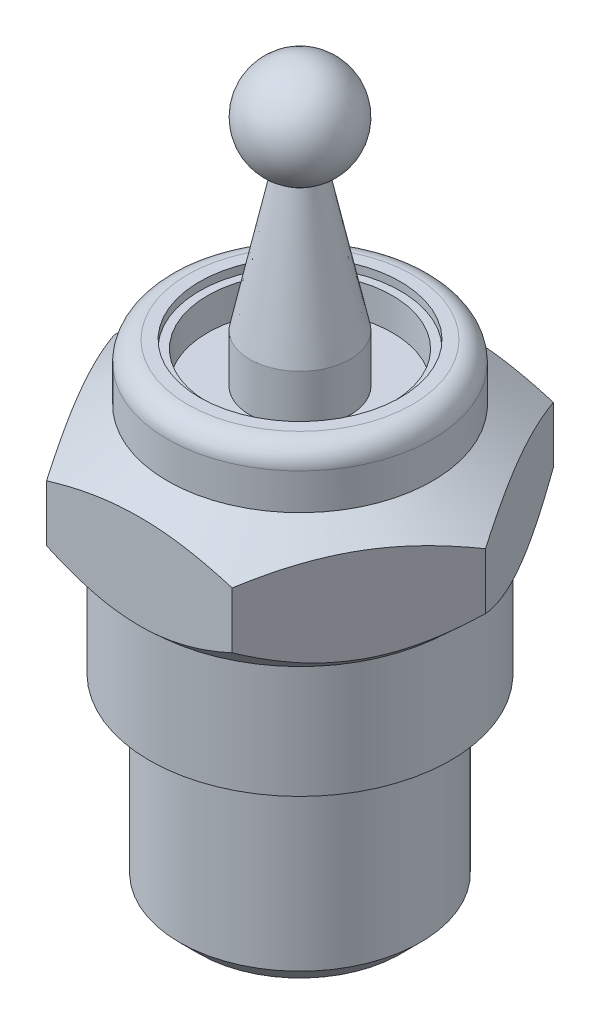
ISO-10303-21;
HEADER;
FILE_DESCRIPTION(('STEP AP214'),'2;1');
FILE_NAME('part.step','',(''),(''),'','','');
FILE_SCHEMA(('AUTOMOTIVE_DESIGN { 1 0 10303 214 1 1 1 1 }'));
ENDSEC;
DATA;
#1=APPLICATION_CONTEXT('core data for automotive mechanical design processes');
#2=APPLICATION_PROTOCOL_DEFINITION('international standard','automotive_design',2000,#1);
#3=PRODUCT_CONTEXT('',#1,'mechanical');
#4=PRODUCT('Part','Part','',(#3));
#5=PRODUCT_RELATED_PRODUCT_CATEGORY('part','',(#4));
#6=PRODUCT_DEFINITION_FORMATION('','',#4);
#7=PRODUCT_DEFINITION_CONTEXT('part definition',#1,'design');
#8=PRODUCT_DEFINITION('design','',#6,#7);
#9=PRODUCT_DEFINITION_SHAPE('','',#8);
#10=(LENGTH_UNIT() NAMED_UNIT(*) SI_UNIT(.MILLI.,.METRE.));
#11=(NAMED_UNIT(*) PLANE_ANGLE_UNIT() SI_UNIT($,.RADIAN.));
#12=(NAMED_UNIT(*) SI_UNIT($,.STERADIAN.) SOLID_ANGLE_UNIT());
#13=UNCERTAINTY_MEASURE_WITH_UNIT(LENGTH_MEASURE(1.E-05),#10,'distance_accuracy_value','');
#14=(GEOMETRIC_REPRESENTATION_CONTEXT(3) GLOBAL_UNCERTAINTY_ASSIGNED_CONTEXT((#13)) GLOBAL_UNIT_ASSIGNED_CONTEXT((#10,
#11,#12)) REPRESENTATION_CONTEXT('',''));
#15=CARTESIAN_POINT('',(0.,0.,0.));
#16=DIRECTION('',(0.,0.,1.));
#17=DIRECTION('',(1.,0.,0.));
#18=AXIS2_PLACEMENT_3D('',#15,#16,#17);
#19=CARTESIAN_POINT('',(4.61880215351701,5.0239048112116,0.));
#20=DIRECTION('',(0.866025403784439,0.,-0.5));
#21=DIRECTION('',(-0.5,0.,-0.866025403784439));
#22=AXIS2_PLACEMENT_3D('',#19,#20,#21);
#23=PLANE('',#22);
#24=DIRECTION('',(0.,1.,0.));
#25=VECTOR('',#24,1.);
#26=CARTESIAN_POINT('',(4.61880215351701,5.0239048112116,0.));
#27=LINE('',#26,#25);
#28=CARTESIAN_POINT('',(4.61880215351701,5.8239048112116,0.));
#29=VERTEX_POINT('',#28);
#30=CARTESIAN_POINT('',(4.61880215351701,7.2239048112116,0.));
#31=VERTEX_POINT('',#30);
#32=EDGE_CURVE('E376',#29,#31,#27,.T.);
#33=ORIENTED_EDGE('',*,*,#32,.F.);
#34=CARTESIAN_POINT('',(4.61891762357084,5.82401114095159,0.000199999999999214));
#35=CARTESIAN_POINT('',(4.53356039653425,5.74547077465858,-0.147643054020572));
#36=CARTESIAN_POINT('',(4.44684006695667,5.67208111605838,-0.297847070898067));
#37=CARTESIAN_POINT('',(4.27025216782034,5.53925145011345,-0.603706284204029));
#38=CARTESIAN_POINT('',(4.18036996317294,5.47989004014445,-0.759386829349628));
#39=CARTESIAN_POINT('',(3.99959930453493,5.38060696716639,-1.07249079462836));
#40=CARTESIAN_POINT('',(3.90875735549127,5.34035760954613,-1.22983366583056));
#41=CARTESIAN_POINT('',(3.72548621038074,5.28172991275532,-1.54726860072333));
#42=CARTESIAN_POINT('',(3.63306126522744,5.26330019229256,-1.7073533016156));
#43=CARTESIAN_POINT('',(3.45982128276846,5.2511213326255,-2.0074137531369));
#44=CARTESIAN_POINT('',(3.37905579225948,5.2544802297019,-2.14730368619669));
#45=CARTESIAN_POINT('',(3.21815321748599,5.27891066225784,-2.42599512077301));
#46=CARTESIAN_POINT('',(3.13801662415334,5.29999486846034,-2.56479577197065));
#47=CARTESIAN_POINT('',(2.97918157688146,5.35810447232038,-2.83990614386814));
#48=CARTESIAN_POINT('',(2.90048416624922,5.39514099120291,-2.9762140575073));
#49=CARTESIAN_POINT('',(2.74501717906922,5.48256303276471,-3.24549077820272));
#50=CARTESIAN_POINT('',(2.668247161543,5.53294547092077,-3.37846034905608));
#51=CARTESIAN_POINT('',(2.54440803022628,5.62405853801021,-3.59295601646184));
#52=CARTESIAN_POINT('',(2.49673615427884,5.66158918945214,-3.67552612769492));
#53=CARTESIAN_POINT('',(2.40235088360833,5.74023679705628,-3.83900621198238));
#54=CARTESIAN_POINT('',(2.35563450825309,5.78133940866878,-3.91992134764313));
#55=CARTESIAN_POINT('',(2.30928560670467,5.82401114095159,-4.0002));
#56=B_SPLINE_CURVE_WITH_KNOTS('',3,(#34,#35,#36,#37,#38,#39,#40,#41,#42,#43,#44,#45,#46,#47,#48,
#49,#50,#51,#52,#53,#54,#55),.UNSPECIFIED.,.F.,.F.,(4,2,2,2,2,2,2,2,2,2,4),(0.,
0.564151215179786,1.13139204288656,1.68852042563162,2.24433424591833,2.72803335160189,
3.21207851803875,3.69646168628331,4.18073300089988,4.48805463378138,4.79419458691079),.UNSPECIFIED.);
#57=CARTESIAN_POINT('',(2.3094010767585,5.8239048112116,-4.));
#58=VERTEX_POINT('',#57);
#59=EDGE_CURVE('E370',#29,#58,#56,.T.);
#60=ORIENTED_EDGE('',*,*,#59,.T.);
#61=DIRECTION('',(0.,1.,0.));
#62=VECTOR('',#61,1.);
#63=CARTESIAN_POINT('',(2.3094010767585,5.0239048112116,-4.));
#64=LINE('',#63,#62);
#65=CARTESIAN_POINT('',(2.3094010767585,7.2239048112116,-4.));
#66=VERTEX_POINT('',#65);
#67=EDGE_CURVE('E442',#58,#66,#64,.T.);
#68=ORIENTED_EDGE('',*,*,#67,.T.);
#69=CARTESIAN_POINT('',(2.30928560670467,7.22383476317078,-4.0002));
#70=CARTESIAN_POINT('',(2.4112300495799,7.28569596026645,-3.82362704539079));
#71=CARTESIAN_POINT('',(2.51414597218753,7.34198831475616,-3.64537143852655));
#72=CARTESIAN_POINT('',(2.72195337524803,7.44021177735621,-3.28543845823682));
#73=CARTESIAN_POINT('',(2.82684945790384,7.48210350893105,-3.10375311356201));
#74=CARTESIAN_POINT('',(3.03520519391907,7.54702973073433,-2.74287039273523));
#75=CARTESIAN_POINT('',(3.13862567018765,7.57054862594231,-2.56374087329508));
#76=CARTESIAN_POINT('',(3.34598903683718,7.59825584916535,-2.20457698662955));
#77=CARTESIAN_POINT('',(3.44993099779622,7.60247108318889,-2.02454422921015));
#78=CARTESIAN_POINT('',(3.6429904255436,7.59200088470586,-1.69015549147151));
#79=CARTESIAN_POINT('',(3.73214585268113,7.57987918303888,-1.53573376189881));
#80=CARTESIAN_POINT('',(3.90981221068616,7.54202142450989,-1.22800660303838));
#81=CARTESIAN_POINT('',(3.99832238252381,7.51627134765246,-1.07470248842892));
#82=CARTESIAN_POINT('',(4.17637902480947,7.45211036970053,-0.76629933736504));
#83=CARTESIAN_POINT('',(4.26589845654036,7.41340716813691,-0.611247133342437));
#84=CARTESIAN_POINT('',(4.44347772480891,7.3257602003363,-0.303670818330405));
#85=CARTESIAN_POINT('',(4.53154032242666,7.27683898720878,-0.151141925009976));
#86=CARTESIAN_POINT('',(4.61891762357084,7.22383476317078,0.000199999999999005));
#87=B_SPLINE_CURVE_WITH_KNOTS('',3,(#69,#70,#71,#72,#73,#74,#75,#76,#77,#78,#79,#80,#81,#82,#83,
#84,#85,#86),.UNSPECIFIED.,.F.,.F.,(4,2,2,2,2,2,2,2,4),(0.,0.639491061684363,1.28071706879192,
1.90440572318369,2.52722479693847,3.06284019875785,3.59900768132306,4.14819687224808,
4.69618647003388),.UNSPECIFIED.);
#88=EDGE_CURVE('E363',#66,#31,#87,.T.);
#89=ORIENTED_EDGE('',*,*,#88,.T.);
#90=EDGE_LOOP('',(#33,#60,#68,#89));
#91=FACE_BOUND('',#90,.T.);
#92=ADVANCED_FACE('F350',(#91),#23,.T.);
#93=CARTESIAN_POINT('',(2.3094010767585,5.0239048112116,-4.));
#94=DIRECTION('',(0.,0.,-1.));
#95=DIRECTION('',(-1.,0.,0.));
#96=AXIS2_PLACEMENT_3D('',#93,#94,#95);
#97=PLANE('',#96);
#98=ORIENTED_EDGE('',*,*,#67,.F.);
#99=CARTESIAN_POINT('',(-4.88550190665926,7.38496837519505,-4.));
#100=CARTESIAN_POINT('',(-4.76407077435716,7.29847259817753,-4.));
#101=CARTESIAN_POINT('',(-4.64203981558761,7.21280527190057,-4.));
#102=CARTESIAN_POINT('',(-4.39653025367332,7.04351086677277,-4.));
#103=CARTESIAN_POINT('',(-4.27305131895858,6.95988426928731,-4.));
#104=CARTESIAN_POINT('',(-4.02353785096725,6.79448793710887,-4.));
#105=CARTESIAN_POINT('',(-3.89749118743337,6.71273644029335,-4.));
#106=CARTESIAN_POINT('',(-3.64347011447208,6.5522952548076,-4.));
#107=CARTESIAN_POINT('',(-3.51549583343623,6.47360536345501,-4.));
#108=CARTESIAN_POINT('',(-3.25008303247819,6.31569134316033,-4.));
#109=CARTESIAN_POINT('',(-3.11251533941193,6.23668321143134,-4.));
#110=CARTESIAN_POINT('',(-2.83444505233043,6.08392606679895,-4.));
#111=CARTESIAN_POINT('',(-2.69394201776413,6.01017785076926,-4.));
#112=CARTESIAN_POINT('',(-2.41000684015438,5.86956399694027,-4.));
#113=CARTESIAN_POINT('',(-2.26658422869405,5.80267926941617,-4.));
#114=CARTESIAN_POINT('',(-1.9761201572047,5.67736895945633,-4.));
#115=CARTESIAN_POINT('',(-1.82908028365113,5.61893974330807,-4.));
#116=CARTESIAN_POINT('',(-1.53878565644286,5.51542707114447,-4.));
#117=CARTESIAN_POINT('',(-1.39572218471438,5.46981372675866,-4.));
#118=CARTESIAN_POINT('',(-1.10632298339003,5.39027524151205,-4.));
#119=CARTESIAN_POINT('',(-0.959987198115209,5.35635029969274,-4.));
#120=CARTESIAN_POINT('',(-0.667455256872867,5.30274417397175,-4.));
#121=CARTESIAN_POINT('',(-0.521305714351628,5.28281328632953,-4.));
#122=CARTESIAN_POINT('',(-0.227740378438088,5.25761975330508,-4.));
#123=CARTESIAN_POINT('',(-0.0803247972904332,5.25235469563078,-4.));
#124=CARTESIAN_POINT('',(0.206338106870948,5.25676925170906,-4.));
#125=CARTESIAN_POINT('',(0.345598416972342,5.26566049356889,-4.));
#126=CARTESIAN_POINT('',(0.622683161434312,5.29631454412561,-4.));
#127=CARTESIAN_POINT('',(0.760507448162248,5.31807866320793,-4.));
#128=CARTESIAN_POINT('',(1.03633957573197,5.37365941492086,-4.));
#129=CARTESIAN_POINT('',(1.17430295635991,5.4076931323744,-4.));
#130=CARTESIAN_POINT('',(1.44724210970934,5.48595283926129,-4.));
#131=CARTESIAN_POINT('',(1.58221823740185,5.53017761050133,-4.));
#132=CARTESIAN_POINT('',(1.88632502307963,5.64055366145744,-4.));
#133=CARTESIAN_POINT('',(2.05447748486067,5.70937989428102,-4.));
#134=CARTESIAN_POINT('',(2.38611281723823,5.85757892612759,-4.));
#135=CARTESIAN_POINT('',(2.54959268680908,5.93695832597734,-4.));
#136=CARTESIAN_POINT('',(2.87299435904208,6.10403030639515,-4.));
#137=CARTESIAN_POINT('',(3.03290036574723,6.19175319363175,-4.));
#138=CARTESIAN_POINT('',(3.34911435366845,6.37333665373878,-4.));
#139=CARTESIAN_POINT('',(3.5054231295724,6.46719585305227,-4.));
#140=CARTESIAN_POINT('',(3.8053682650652,6.6536496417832,-4.));
#141=CARTESIAN_POINT('',(3.94918521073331,6.74595532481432,-4.));
#142=CARTESIAN_POINT('',(4.23462747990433,6.93390955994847,-4.));
#143=CARTESIAN_POINT('',(4.37625262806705,7.02955837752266,-4.));
#144=CARTESIAN_POINT('',(4.65636173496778,7.22265177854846,-4.));
#145=CARTESIAN_POINT('',(4.79486257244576,7.32007196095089,-4.));
#146=CARTESIAN_POINT('',(5.07027663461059,7.51706215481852,-4.));
#147=CARTESIAN_POINT('',(5.20719024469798,7.61663162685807,-4.));
#148=CARTESIAN_POINT('',(5.34346148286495,7.71705831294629,-4.));
#149=B_SPLINE_CURVE_WITH_KNOTS('',3,(#99,#100,#101,#102,#103,#104,#105,#106,#107,#108,#109,#110,
#111,#112,#113,#114,#115,#116,#117,#118,#119,#120,#121,#122,#123,#124,#125,#126,#127,#128,#129,
#130,#131,#132,#133,#134,#135,#136,#137,#138,#139,#140,#141,#142,#143,#144,#145,#146,#147,#148),
.UNSPECIFIED.,.F.,.F.,(4,2,2,2,2,2,2,2,2,2,2,2,2,2,2,2,2,2,2,2,2,2,2,2,4),(0.,0.447270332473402,
0.894645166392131,1.34531866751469,1.79596228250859,2.27179524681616,2.74770014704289,
3.22224331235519,3.69658193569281,4.14665025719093,4.59672624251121,5.03855184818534,
5.48030477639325,5.89830405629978,6.31634589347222,6.74217958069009,7.1679623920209,
7.71254515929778,8.25747017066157,8.80445620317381,9.35132021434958,9.86393701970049,
10.3765946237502,10.8845669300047,11.3924131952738),.UNSPECIFIED.);
#150=CARTESIAN_POINT('',(-2.3094010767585,5.8239048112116,-4.));
#151=VERTEX_POINT('',#150);
#152=EDGE_CURVE('E546',#58,#151,#149,.F.);
#153=ORIENTED_EDGE('',*,*,#152,.T.);
#154=DIRECTION('',(0.,1.,0.));
#155=VECTOR('',#154,1.);
#156=CARTESIAN_POINT('',(-2.3094010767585,5.0239048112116,-4.));
#157=LINE('',#156,#155);
#158=CARTESIAN_POINT('',(-2.30940107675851,7.2239048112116,-4.));
#159=VERTEX_POINT('',#158);
#160=EDGE_CURVE('E440',#151,#159,#157,.T.);
#161=ORIENTED_EDGE('',*,*,#160,.T.);
#162=CARTESIAN_POINT('',(-5.96407807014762,5.66950080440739,-4.));
#163=CARTESIAN_POINT('',(-5.79505186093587,5.75463118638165,-4.));
#164=CARTESIAN_POINT('',(-5.6255869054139,5.83890610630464,-4.));
#165=CARTESIAN_POINT('',(-5.28554989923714,6.00526792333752,-4.));
#166=CARTESIAN_POINT('',(-5.11497765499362,6.08735442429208,-4.));
#167=CARTESIAN_POINT('',(-4.77150840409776,6.24932587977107,-4.));
#168=CARTESIAN_POINT('',(-4.59860355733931,6.32919426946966,-4.));
#169=CARTESIAN_POINT('',(-4.25125641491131,6.48550232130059,-4.));
#170=CARTESIAN_POINT('',(-4.07681420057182,6.56194216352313,-4.));
#171=CARTESIAN_POINT('',(-3.72068081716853,6.71278560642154,-4.));
#172=CARTESIAN_POINT('',(-3.53893196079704,6.78705378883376,-4.));
#173=CARTESIAN_POINT('',(-3.17309255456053,6.92969397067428,-4.));
#174=CARTESIAN_POINT('',(-2.98900172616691,6.99806526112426,-4.));
#175=CARTESIAN_POINT('',(-2.61856694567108,7.12703788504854,-4.));
#176=CARTESIAN_POINT('',(-2.43222918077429,7.1876568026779,-4.));
#177=CARTESIAN_POINT('',(-2.0566843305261,7.29913038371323,-4.));
#178=CARTESIAN_POINT('',(-1.86747825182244,7.34998839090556,-4.));
#179=CARTESIAN_POINT('',(-1.48246363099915,7.44027547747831,-4.));
#180=CARTESIAN_POINT('',(-1.2865980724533,7.47946633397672,-4.));
#181=CARTESIAN_POINT('',(-0.892349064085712,7.54230313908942,-4.));
#182=CARTESIAN_POINT('',(-0.693965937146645,7.56595106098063,-4.));
#183=CARTESIAN_POINT('',(-0.298519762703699,7.59540040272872,-4.));
#184=CARTESIAN_POINT('',(-0.101474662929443,7.60143678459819,-4.));
#185=CARTESIAN_POINT('',(0.292378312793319,7.59573580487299,-4.));
#186=CARTESIAN_POINT('',(0.489186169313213,7.58399707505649,-4.));
#187=CARTESIAN_POINT('',(0.818813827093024,7.55025797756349,-4.));
#188=CARTESIAN_POINT('',(0.952113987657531,7.53269796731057,-4.));
#189=CARTESIAN_POINT('',(1.21760357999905,7.49053992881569,-4.));
#190=CARTESIAN_POINT('',(1.34979286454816,7.46594098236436,-4.));
#191=CARTESIAN_POINT('',(1.74454794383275,7.38278556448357,-4.));
#192=CARTESIAN_POINT('',(2.00516431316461,7.31488606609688,-4.));
#193=CARTESIAN_POINT('',(2.39469138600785,7.19853643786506,-4.));
#194=CARTESIAN_POINT('',(2.52571980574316,7.1567993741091,-4.));
#195=CARTESIAN_POINT('',(2.78644188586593,7.06931128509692,-4.));
#196=CARTESIAN_POINT('',(2.91613553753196,7.02356023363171,-4.));
#197=CARTESIAN_POINT('',(3.1742360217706,6.92872180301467,-4.));
#198=CARTESIAN_POINT('',(3.30264328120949,6.87963557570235,-4.));
#199=CARTESIAN_POINT('',(3.55834495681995,6.77865706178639,-4.));
#200=CARTESIAN_POINT('',(3.68563938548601,6.72676480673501,-4.));
#201=CARTESIAN_POINT('',(3.98679746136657,6.6007261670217,-4.));
#202=CARTESIAN_POINT('',(4.16022205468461,6.52553242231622,-4.));
#203=CARTESIAN_POINT('',(4.50550901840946,6.37163030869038,-4.));
#204=CARTESIAN_POINT('',(4.67737129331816,6.29292172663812,-4.));
#205=CARTESIAN_POINT('',(5.0198154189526,6.13268310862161,-4.));
#206=CARTESIAN_POINT('',(5.19039699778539,6.05115249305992,-4.));
#207=CARTESIAN_POINT('',(5.53045825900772,5.88582142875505,-4.));
#208=CARTESIAN_POINT('',(5.69993791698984,5.80202092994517,-4.));
#209=CARTESIAN_POINT('',(6.20734538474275,5.5476900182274,-4.));
#210=CARTESIAN_POINT('',(6.54388816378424,5.3743978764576,-4.));
#211=CARTESIAN_POINT('',(7.21434219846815,5.02279755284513,-4.));
#212=CARTESIAN_POINT('',(7.54825335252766,4.84448917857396,-4.));
#213=CARTESIAN_POINT('',(8.18585715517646,4.49958815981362,-4.));
#214=CARTESIAN_POINT('',(8.48970762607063,4.33328672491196,-4.));
#215=CARTESIAN_POINT('',(9.09617010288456,3.99841902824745,-4.));
#216=CARTESIAN_POINT('',(9.39878206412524,3.82985268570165,-4.));
#217=CARTESIAN_POINT('',(10.0022506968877,3.49142514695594,-4.));
#218=CARTESIAN_POINT('',(10.3031098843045,3.32156843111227,-4.));
#219=CARTESIAN_POINT('',(10.9040314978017,2.98049059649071,-4.));
#220=CARTESIAN_POINT('',(11.2040939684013,2.80926955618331,-4.));
#221=CARTESIAN_POINT('',(11.5038610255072,2.63753662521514,-4.));
#222=B_SPLINE_CURVE_WITH_KNOTS('',3,(#162,#163,#164,#165,#166,#167,#168,#169,#170,#171,#172,
#173,#174,#175,#176,#177,#178,#179,#180,#181,#182,#183,#184,#185,#186,#187,#188,#189,#190,#191,
#192,#193,#194,#195,#196,#197,#198,#199,#200,#201,#202,#203,#204,#205,#206,#207,#208,#209,#210,
#211,#212,#213,#214,#215,#216,#217,#218,#219,#220,#221),.UNSPECIFIED.,.F.,.F.,(4,2,2,2,2,2,2,2,
2,2,2,2,2,2,2,2,2,2,2,2,2,2,2,2,2,2,2,2,2,4),(0.,0.567769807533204,1.13564170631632,
1.70699196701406,2.27831218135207,2.86724498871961,3.45624850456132,4.04389139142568,
4.6313326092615,5.23005441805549,5.82870020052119,6.41932186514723,7.00998899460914,
7.41315431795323,7.8163722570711,8.6232189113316,9.03573050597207,9.44824479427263,
9.86061733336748,10.2729852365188,10.8400057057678,11.4070606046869,11.974232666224,
12.5414172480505,13.6769599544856,14.8125462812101,15.851683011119,16.8908569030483,
17.9273412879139,18.9637664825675),.UNSPECIFIED.);
#223=EDGE_CURVE('E509',#159,#66,#222,.T.);
#224=ORIENTED_EDGE('',*,*,#223,.T.);
#225=EDGE_LOOP('',(#98,#153,#161,#224));
#226=FACE_BOUND('',#225,.T.);
#227=ADVANCED_FACE('F562',(#226),#97,.T.);
#228=CARTESIAN_POINT('',(-2.3094010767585,5.0239048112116,-4.));
#229=DIRECTION('',(-0.866025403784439,0.,-0.5));
#230=DIRECTION('',(-0.5,0.,0.866025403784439));
#231=AXIS2_PLACEMENT_3D('',#228,#229,#230);
#232=PLANE('',#231);
#233=ORIENTED_EDGE('',*,*,#160,.F.);
#234=CARTESIAN_POINT('',(-2.30928560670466,5.82401114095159,-4.0002));
#235=CARTESIAN_POINT('',(-2.39464283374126,5.74547077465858,-3.85235694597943));
#236=CARTESIAN_POINT('',(-2.48136316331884,5.67208111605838,-3.70215292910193));
#237=CARTESIAN_POINT('',(-2.65795106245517,5.53925145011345,-3.39629371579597));
#238=CARTESIAN_POINT('',(-2.74783326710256,5.47989004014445,-3.24061317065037));
#239=CARTESIAN_POINT('',(-2.92860392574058,5.38060696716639,-2.92750920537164));
#240=CARTESIAN_POINT('',(-3.01944587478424,5.34035760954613,-2.77016633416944));
#241=CARTESIAN_POINT('',(-3.20271701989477,5.28172991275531,-2.45273139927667));
#242=CARTESIAN_POINT('',(-3.29514196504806,5.26330019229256,-2.2926466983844));
#243=CARTESIAN_POINT('',(-3.46838194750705,5.25112133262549,-1.9925862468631));
#244=CARTESIAN_POINT('',(-3.54914743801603,5.2544802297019,-1.85269631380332));
#245=CARTESIAN_POINT('',(-3.71005001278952,5.27891066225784,-1.57400487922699));
#246=CARTESIAN_POINT('',(-3.79018660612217,5.29999486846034,-1.43520422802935));
#247=CARTESIAN_POINT('',(-3.94902165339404,5.35810447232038,-1.16009385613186));
#248=CARTESIAN_POINT('',(-4.02771906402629,5.39514099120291,-1.0237859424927));
#249=CARTESIAN_POINT('',(-4.18318605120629,5.48256303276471,-0.75450922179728));
#250=CARTESIAN_POINT('',(-4.2599560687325,5.53294547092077,-0.621539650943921));
#251=CARTESIAN_POINT('',(-4.38379520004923,5.62405853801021,-0.407043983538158));
#252=CARTESIAN_POINT('',(-4.43146707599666,5.66158918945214,-0.324473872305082));
#253=CARTESIAN_POINT('',(-4.52585234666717,5.74023679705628,-0.160993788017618));
#254=CARTESIAN_POINT('',(-4.57256872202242,5.78133940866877,-0.0800786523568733));
#255=CARTESIAN_POINT('',(-4.61891762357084,5.82401114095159,0.000200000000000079));
#256=B_SPLINE_CURVE_WITH_KNOTS('',3,(#234,#235,#236,#237,#238,#239,#240,#241,#242,#243,#244,
#245,#246,#247,#248,#249,#250,#251,#252,#253,#254,#255),.UNSPECIFIED.,.F.,.F.,(4,2,2,2,2,2,2,2,
2,2,4),(0.,0.564151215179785,1.13139204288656,1.68852042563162,2.24433424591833,
2.72803335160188,3.21207851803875,3.69646168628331,4.18073300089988,4.48805463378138,
4.79419458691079),.UNSPECIFIED.);
#257=CARTESIAN_POINT('',(-4.61880215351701,5.8239048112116,0.));
#258=VERTEX_POINT('',#257);
#259=EDGE_CURVE('E557',#151,#258,#256,.T.);
#260=ORIENTED_EDGE('',*,*,#259,.T.);
#261=DIRECTION('',(0.,1.,0.));
#262=VECTOR('',#261,1.);
#263=CARTESIAN_POINT('',(-4.618802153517,5.0239048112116,0.));
#264=LINE('',#263,#262);
#265=CARTESIAN_POINT('',(-4.61880215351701,7.2239048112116,0.));
#266=VERTEX_POINT('',#265);
#267=EDGE_CURVE('E430',#258,#266,#264,.T.);
#268=ORIENTED_EDGE('',*,*,#267,.T.);
#269=CARTESIAN_POINT('',(-4.61891762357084,7.22383476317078,0.000200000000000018));
#270=CARTESIAN_POINT('',(-4.51697318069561,7.28569596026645,-0.176372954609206));
#271=CARTESIAN_POINT('',(-4.41405725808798,7.34198831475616,-0.354628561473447));
#272=CARTESIAN_POINT('',(-4.20624985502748,7.44021177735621,-0.714561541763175));
#273=CARTESIAN_POINT('',(-4.10135377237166,7.48210350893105,-0.896246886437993));
#274=CARTESIAN_POINT('',(-3.89299803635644,7.54702973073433,-1.25712960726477));
#275=CARTESIAN_POINT('',(-3.78957756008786,7.57054862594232,-1.43625912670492));
#276=CARTESIAN_POINT('',(-3.58221419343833,7.59825584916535,-1.79542301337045));
#277=CARTESIAN_POINT('',(-3.47827223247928,7.60247108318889,-1.97545577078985));
#278=CARTESIAN_POINT('',(-3.2852128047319,7.59200088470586,-2.30984450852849));
#279=CARTESIAN_POINT('',(-3.19605737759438,7.57987918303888,-2.46426623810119));
#280=CARTESIAN_POINT('',(-3.01839101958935,7.5420214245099,-2.77199339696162));
#281=CARTESIAN_POINT('',(-2.9298808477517,7.51627134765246,-2.92529751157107));
#282=CARTESIAN_POINT('',(-2.75182420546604,7.45211036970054,-3.23370066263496));
#283=CARTESIAN_POINT('',(-2.66230477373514,7.41340716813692,-3.38875286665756));
#284=CARTESIAN_POINT('',(-2.48472550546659,7.3257602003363,-3.69632918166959));
#285=CARTESIAN_POINT('',(-2.39666290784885,7.27683898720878,-3.84885807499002));
#286=CARTESIAN_POINT('',(-2.30928560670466,7.22383476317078,-4.0002));
#287=B_SPLINE_CURVE_WITH_KNOTS('',3,(#269,#270,#271,#272,#273,#274,#275,#276,#277,#278,#279,
#280,#281,#282,#283,#284,#285,#286),.UNSPECIFIED.,.F.,.F.,(4,2,2,2,2,2,2,2,4),(0.,
0.639491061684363,1.28071706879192,1.90440572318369,2.52722479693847,3.06284019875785,
3.59900768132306,4.14819687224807,4.69618647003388),.UNSPECIFIED.);
#288=EDGE_CURVE('E516',#266,#159,#287,.T.);
#289=ORIENTED_EDGE('',*,*,#288,.T.);
#290=EDGE_LOOP('',(#233,#260,#268,#289));
#291=FACE_BOUND('',#290,.T.);
#292=ADVANCED_FACE('F565',(#291),#232,.T.);
#293=CARTESIAN_POINT('',(-4.618802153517,5.0239048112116,0.));
#294=DIRECTION('',(-0.866025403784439,0.,0.5));
#295=DIRECTION('',(0.5,0.,0.866025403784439));
#296=AXIS2_PLACEMENT_3D('',#293,#294,#295);
#297=PLANE('',#296);
#298=ORIENTED_EDGE('',*,*,#267,.F.);
#299=CARTESIAN_POINT('',(-4.61891762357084,5.82401114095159,-0.000199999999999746));
#300=CARTESIAN_POINT('',(-4.53356039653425,5.74547077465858,0.147643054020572));
#301=CARTESIAN_POINT('',(-4.44684006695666,5.67208111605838,0.297847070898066));
#302=CARTESIAN_POINT('',(-4.27025216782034,5.53925145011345,0.603706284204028));
#303=CARTESIAN_POINT('',(-4.18036996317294,5.47989004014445,0.759386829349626));
#304=CARTESIAN_POINT('',(-3.99959930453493,5.38060696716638,1.07249079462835));
#305=CARTESIAN_POINT('',(-3.90875735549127,5.34035760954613,1.22983366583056));
#306=CARTESIAN_POINT('',(-3.72548621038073,5.28172991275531,1.54726860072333));
#307=CARTESIAN_POINT('',(-3.63306126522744,5.26330019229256,1.7073533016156));
#308=CARTESIAN_POINT('',(-3.45982128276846,5.25112133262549,2.0074137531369));
#309=CARTESIAN_POINT('',(-3.37905579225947,5.2544802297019,2.14730368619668));
#310=CARTESIAN_POINT('',(-3.21815321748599,5.27891066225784,2.42599512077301));
#311=CARTESIAN_POINT('',(-3.13801662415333,5.29999486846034,2.56479577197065));
#312=CARTESIAN_POINT('',(-2.97918157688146,5.35810447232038,2.83990614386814));
#313=CARTESIAN_POINT('',(-2.90048416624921,5.39514099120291,2.9762140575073));
#314=CARTESIAN_POINT('',(-2.74501717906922,5.48256303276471,3.24549077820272));
#315=CARTESIAN_POINT('',(-2.668247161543,5.53294547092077,3.37846034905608));
#316=CARTESIAN_POINT('',(-2.54440803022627,5.62405853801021,3.59295601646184));
#317=CARTESIAN_POINT('',(-2.49673615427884,5.66158918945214,3.67552612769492));
#318=CARTESIAN_POINT('',(-2.40235088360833,5.74023679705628,3.83900621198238));
#319=CARTESIAN_POINT('',(-2.35563450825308,5.78133940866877,3.91992134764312));
#320=CARTESIAN_POINT('',(-2.30928560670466,5.82401114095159,4.0002));
#321=B_SPLINE_CURVE_WITH_KNOTS('',3,(#299,#300,#301,#302,#303,#304,#305,#306,#307,#308,#309,
#310,#311,#312,#313,#314,#315,#316,#317,#318,#319,#320),.UNSPECIFIED.,.F.,.F.,(4,2,2,2,2,2,2,2,
2,2,4),(0.,0.564151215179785,1.13139204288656,1.68852042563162,2.24433424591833,
2.72803335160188,3.21207851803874,3.69646168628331,4.18073300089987,4.48805463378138,
4.79419458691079),.UNSPECIFIED.);
#322=CARTESIAN_POINT('',(-2.3094010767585,5.8239048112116,4.));
#323=VERTEX_POINT('',#322);
#324=EDGE_CURVE('E420',#258,#323,#321,.T.);
#325=ORIENTED_EDGE('',*,*,#324,.T.);
#326=DIRECTION('',(0.,1.,0.));
#327=VECTOR('',#326,1.);
#328=CARTESIAN_POINT('',(-2.3094010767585,5.0239048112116,4.));
#329=LINE('',#328,#327);
#330=CARTESIAN_POINT('',(-2.3094010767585,7.2239048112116,4.));
#331=VERTEX_POINT('',#330);
#332=EDGE_CURVE('E419',#323,#331,#329,.T.);
#333=ORIENTED_EDGE('',*,*,#332,.T.);
#334=CARTESIAN_POINT('',(-2.30928560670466,7.22383476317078,4.0002));
#335=CARTESIAN_POINT('',(-2.41123004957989,7.28569596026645,3.82362704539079));
#336=CARTESIAN_POINT('',(-2.51414597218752,7.34198831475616,3.64537143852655));
#337=CARTESIAN_POINT('',(-2.72195337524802,7.44021177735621,3.28543845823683));
#338=CARTESIAN_POINT('',(-2.82684945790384,7.48210350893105,3.10375311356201));
#339=CARTESIAN_POINT('',(-3.03520519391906,7.54702973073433,2.74287039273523));
#340=CARTESIAN_POINT('',(-3.13862567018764,7.57054862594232,2.56374087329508));
#341=CARTESIAN_POINT('',(-3.34598903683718,7.59825584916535,2.20457698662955));
#342=CARTESIAN_POINT('',(-3.44993099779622,7.60247108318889,2.02454422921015));
#343=CARTESIAN_POINT('',(-3.6429904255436,7.59200088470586,1.69015549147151));
#344=CARTESIAN_POINT('',(-3.73214585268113,7.57987918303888,1.53573376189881));
#345=CARTESIAN_POINT('',(-3.90981221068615,7.5420214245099,1.22800660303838));
#346=CARTESIAN_POINT('',(-3.9983223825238,7.51627134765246,1.07470248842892));
#347=CARTESIAN_POINT('',(-4.17637902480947,7.45211036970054,0.76629933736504));
#348=CARTESIAN_POINT('',(-4.26589845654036,7.41340716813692,0.611247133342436));
#349=CARTESIAN_POINT('',(-4.44347772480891,7.3257602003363,0.303670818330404));
#350=CARTESIAN_POINT('',(-4.53154032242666,7.27683898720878,0.151141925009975));
#351=CARTESIAN_POINT('',(-4.61891762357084,7.22383476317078,-0.000200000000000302));
#352=B_SPLINE_CURVE_WITH_KNOTS('',3,(#334,#335,#336,#337,#338,#339,#340,#341,#342,#343,#344,
#345,#346,#347,#348,#349,#350,#351),.UNSPECIFIED.,.F.,.F.,(4,2,2,2,2,2,2,2,4),(0.,
0.639491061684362,1.28071706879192,1.90440572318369,2.52722479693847,3.06284019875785,
3.59900768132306,4.14819687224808,4.69618647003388),.UNSPECIFIED.);
#353=EDGE_CURVE('E522',#331,#266,#352,.T.);
#354=ORIENTED_EDGE('',*,*,#353,.T.);
#355=EDGE_LOOP('',(#298,#325,#333,#354));
#356=FACE_BOUND('',#355,.T.);
#357=ADVANCED_FACE('F569',(#356),#297,.T.);
#358=CARTESIAN_POINT('',(-2.3094010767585,5.0239048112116,4.));
#359=DIRECTION('',(0.,0.,1.));
#360=DIRECTION('',(1.,0.,0.));
#361=AXIS2_PLACEMENT_3D('',#358,#359,#360);
#362=PLANE('',#361);
#363=ORIENTED_EDGE('',*,*,#332,.F.);
#364=CARTESIAN_POINT('',(-4.88550190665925,7.38496837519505,4.));
#365=CARTESIAN_POINT('',(-4.76407077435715,7.29847259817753,4.));
#366=CARTESIAN_POINT('',(-4.64203981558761,7.21280527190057,4.));
#367=CARTESIAN_POINT('',(-4.39653025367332,7.04351086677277,4.));
#368=CARTESIAN_POINT('',(-4.27305131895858,6.95988426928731,4.));
#369=CARTESIAN_POINT('',(-4.02353785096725,6.79448793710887,4.));
#370=CARTESIAN_POINT('',(-3.89749118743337,6.71273644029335,4.));
#371=CARTESIAN_POINT('',(-3.64347011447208,6.5522952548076,4.));
#372=CARTESIAN_POINT('',(-3.51549583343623,6.47360536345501,4.));
#373=CARTESIAN_POINT('',(-3.25008303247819,6.31569134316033,4.));
#374=CARTESIAN_POINT('',(-3.11251533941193,6.23668321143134,4.));
#375=CARTESIAN_POINT('',(-2.83444505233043,6.08392606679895,4.));
#376=CARTESIAN_POINT('',(-2.69394201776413,6.01017785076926,4.));
#377=CARTESIAN_POINT('',(-2.41000684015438,5.86956399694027,4.));
#378=CARTESIAN_POINT('',(-2.26658422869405,5.80267926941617,4.));
#379=CARTESIAN_POINT('',(-1.9761201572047,5.67736895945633,4.));
#380=CARTESIAN_POINT('',(-1.82908028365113,5.61893974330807,4.));
#381=CARTESIAN_POINT('',(-1.53878565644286,5.51542707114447,4.));
#382=CARTESIAN_POINT('',(-1.39572218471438,5.46981372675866,4.));
#383=CARTESIAN_POINT('',(-1.10632298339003,5.39027524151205,4.));
#384=CARTESIAN_POINT('',(-0.959987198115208,5.35635029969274,4.));
#385=CARTESIAN_POINT('',(-0.667455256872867,5.30274417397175,4.));
#386=CARTESIAN_POINT('',(-0.521305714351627,5.28281328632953,4.));
#387=CARTESIAN_POINT('',(-0.227740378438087,5.25761975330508,4.));
#388=CARTESIAN_POINT('',(-0.0803247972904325,5.25235469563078,4.));
#389=CARTESIAN_POINT('',(0.206338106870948,5.25676925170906,4.));
#390=CARTESIAN_POINT('',(0.345598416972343,5.26566049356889,4.));
#391=CARTESIAN_POINT('',(0.622683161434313,5.29631454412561,4.));
#392=CARTESIAN_POINT('',(0.760507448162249,5.31807866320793,4.));
#393=CARTESIAN_POINT('',(1.03633957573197,5.37365941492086,4.));
#394=CARTESIAN_POINT('',(1.17430295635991,5.4076931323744,4.));
#395=CARTESIAN_POINT('',(1.44724210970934,5.48595283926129,4.));
#396=CARTESIAN_POINT('',(1.58221823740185,5.53017761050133,4.));
#397=CARTESIAN_POINT('',(1.88632502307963,5.64055366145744,4.));
#398=CARTESIAN_POINT('',(2.05447748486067,5.70937989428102,4.));
#399=CARTESIAN_POINT('',(2.38611281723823,5.85757892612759,4.));
#400=CARTESIAN_POINT('',(2.54959268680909,5.93695832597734,4.));
#401=CARTESIAN_POINT('',(2.87299435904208,6.10403030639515,4.));
#402=CARTESIAN_POINT('',(3.03290036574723,6.19175319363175,4.));
#403=CARTESIAN_POINT('',(3.34911435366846,6.37333665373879,4.));
#404=CARTESIAN_POINT('',(3.5054231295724,6.46719585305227,4.));
#405=CARTESIAN_POINT('',(3.8053682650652,6.6536496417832,4.));
#406=CARTESIAN_POINT('',(3.94918521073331,6.74595532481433,4.));
#407=CARTESIAN_POINT('',(4.23462747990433,6.93390955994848,4.));
#408=CARTESIAN_POINT('',(4.37625262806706,7.02955837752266,4.));
#409=CARTESIAN_POINT('',(4.65636173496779,7.22265177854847,4.));
#410=CARTESIAN_POINT('',(4.79486257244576,7.32007196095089,4.));
#411=CARTESIAN_POINT('',(5.07027663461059,7.51706215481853,4.));
#412=CARTESIAN_POINT('',(5.20719024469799,7.61663162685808,4.));
#413=CARTESIAN_POINT('',(5.34346148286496,7.7170583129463,4.));
#414=B_SPLINE_CURVE_WITH_KNOTS('',3,(#364,#365,#366,#367,#368,#369,#370,#371,#372,#373,#374,
#375,#376,#377,#378,#379,#380,#381,#382,#383,#384,#385,#386,#387,#388,#389,#390,#391,#392,#393,
#394,#395,#396,#397,#398,#399,#400,#401,#402,#403,#404,#405,#406,#407,#408,#409,#410,#411,#412,
#413),.UNSPECIFIED.,.F.,.F.,(4,2,2,2,2,2,2,2,2,2,2,2,2,2,2,2,2,2,2,2,2,2,2,2,4),(0.,
0.4472703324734,0.89464516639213,1.34531866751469,1.79596228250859,2.27179524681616,
2.74770014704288,3.22224331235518,3.69658193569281,4.14665025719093,4.59672624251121,
5.03855184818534,5.48030477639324,5.89830405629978,6.31634589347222,6.74217958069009,
7.16796239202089,7.71254515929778,8.25747017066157,8.80445620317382,9.35132021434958,
9.8639370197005,10.3765946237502,10.8845669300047,11.3924131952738),.UNSPECIFIED.);
#415=CARTESIAN_POINT('',(2.3094010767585,5.8239048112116,4.));
#416=VERTEX_POINT('',#415);
#417=EDGE_CURVE('E410',#323,#416,#414,.T.);
#418=ORIENTED_EDGE('',*,*,#417,.T.);
#419=DIRECTION('',(0.,1.,0.));
#420=VECTOR('',#419,1.);
#421=CARTESIAN_POINT('',(2.3094010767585,5.0239048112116,4.));
#422=LINE('',#421,#420);
#423=CARTESIAN_POINT('',(2.3094010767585,7.2239048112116,4.));
#424=VERTEX_POINT('',#423);
#425=EDGE_CURVE('E417',#416,#424,#422,.T.);
#426=ORIENTED_EDGE('',*,*,#425,.T.);
#427=CARTESIAN_POINT('',(-5.96407807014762,5.66950080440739,4.));
#428=CARTESIAN_POINT('',(-5.79505186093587,5.75463118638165,4.));
#429=CARTESIAN_POINT('',(-5.6255869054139,5.83890610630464,4.));
#430=CARTESIAN_POINT('',(-5.28554989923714,6.00526792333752,4.));
#431=CARTESIAN_POINT('',(-5.11497765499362,6.08735442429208,4.));
#432=CARTESIAN_POINT('',(-4.77150840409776,6.24932587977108,4.));
#433=CARTESIAN_POINT('',(-4.59860355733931,6.32919426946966,4.));
#434=CARTESIAN_POINT('',(-4.25125641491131,6.48550232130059,4.));
#435=CARTESIAN_POINT('',(-4.07681420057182,6.56194216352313,4.));
#436=CARTESIAN_POINT('',(-3.72068081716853,6.71278560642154,4.));
#437=CARTESIAN_POINT('',(-3.53893196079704,6.78705378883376,4.));
#438=CARTESIAN_POINT('',(-3.17309255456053,6.92969397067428,4.));
#439=CARTESIAN_POINT('',(-2.98900172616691,6.99806526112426,4.));
#440=CARTESIAN_POINT('',(-2.61856694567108,7.12703788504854,4.));
#441=CARTESIAN_POINT('',(-2.43222918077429,7.1876568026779,4.));
#442=CARTESIAN_POINT('',(-2.0566843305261,7.29913038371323,4.));
#443=CARTESIAN_POINT('',(-1.86747825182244,7.34998839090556,4.));
#444=CARTESIAN_POINT('',(-1.48246363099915,7.44027547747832,4.));
#445=CARTESIAN_POINT('',(-1.2865980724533,7.47946633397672,4.));
#446=CARTESIAN_POINT('',(-0.892349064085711,7.54230313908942,4.));
#447=CARTESIAN_POINT('',(-0.693965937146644,7.56595106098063,4.));
#448=CARTESIAN_POINT('',(-0.298519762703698,7.59540040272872,4.));
#449=CARTESIAN_POINT('',(-0.101474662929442,7.60143678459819,4.));
#450=CARTESIAN_POINT('',(0.29237831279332,7.59573580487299,4.));
#451=CARTESIAN_POINT('',(0.489186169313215,7.58399707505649,4.));
#452=CARTESIAN_POINT('',(0.818813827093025,7.55025797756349,4.));
#453=CARTESIAN_POINT('',(0.952113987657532,7.53269796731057,4.));
#454=CARTESIAN_POINT('',(1.21760357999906,7.49053992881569,4.));
#455=CARTESIAN_POINT('',(1.34979286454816,7.46594098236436,4.));
#456=CARTESIAN_POINT('',(1.74454794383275,7.38278556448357,4.));
#457=CARTESIAN_POINT('',(2.00516431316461,7.31488606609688,4.));
#458=CARTESIAN_POINT('',(2.39469138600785,7.19853643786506,4.));
#459=CARTESIAN_POINT('',(2.52571980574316,7.1567993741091,4.));
#460=CARTESIAN_POINT('',(2.78644188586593,7.06931128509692,4.));
#461=CARTESIAN_POINT('',(2.91613553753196,7.02356023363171,4.));
#462=CARTESIAN_POINT('',(3.1742360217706,6.92872180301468,4.));
#463=CARTESIAN_POINT('',(3.30264328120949,6.87963557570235,4.));
#464=CARTESIAN_POINT('',(3.55834495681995,6.77865706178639,4.));
#465=CARTESIAN_POINT('',(3.68563938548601,6.72676480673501,4.));
#466=CARTESIAN_POINT('',(3.98679746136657,6.6007261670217,4.));
#467=CARTESIAN_POINT('',(4.16022205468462,6.52553242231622,4.));
#468=CARTESIAN_POINT('',(4.50550901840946,6.37163030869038,4.));
#469=CARTESIAN_POINT('',(4.67737129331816,6.29292172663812,4.));
#470=CARTESIAN_POINT('',(5.0198154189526,6.13268310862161,4.));
#471=CARTESIAN_POINT('',(5.19039699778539,6.05115249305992,4.));
#472=CARTESIAN_POINT('',(5.53045825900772,5.88582142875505,4.));
#473=CARTESIAN_POINT('',(5.69993791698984,5.80202092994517,4.));
#474=CARTESIAN_POINT('',(6.20734538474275,5.5476900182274,4.));
#475=CARTESIAN_POINT('',(6.54388816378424,5.37439787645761,4.));
#476=CARTESIAN_POINT('',(7.21434219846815,5.02279755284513,4.));
#477=CARTESIAN_POINT('',(7.54825335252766,4.84448917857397,4.));
#478=CARTESIAN_POINT('',(8.18585715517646,4.49958815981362,4.));
#479=CARTESIAN_POINT('',(8.48970762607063,4.33328672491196,4.));
#480=CARTESIAN_POINT('',(9.09617010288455,3.99841902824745,4.));
#481=CARTESIAN_POINT('',(9.39878206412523,3.82985268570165,4.));
#482=CARTESIAN_POINT('',(10.0022506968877,3.49142514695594,4.));
#483=CARTESIAN_POINT('',(10.3031098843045,3.32156843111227,4.));
#484=CARTESIAN_POINT('',(10.9040314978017,2.98049059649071,4.));
#485=CARTESIAN_POINT('',(11.2040939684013,2.80926955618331,4.));
#486=CARTESIAN_POINT('',(11.5038610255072,2.63753662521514,4.));
#487=B_SPLINE_CURVE_WITH_KNOTS('',3,(#427,#428,#429,#430,#431,#432,#433,#434,#435,#436,#437,
#438,#439,#440,#441,#442,#443,#444,#445,#446,#447,#448,#449,#450,#451,#452,#453,#454,#455,#456,
#457,#458,#459,#460,#461,#462,#463,#464,#465,#466,#467,#468,#469,#470,#471,#472,#473,#474,#475,
#476,#477,#478,#479,#480,#481,#482,#483,#484,#485,#486),.UNSPECIFIED.,.F.,.F.,(4,2,2,2,2,2,2,2,
2,2,2,2,2,2,2,2,2,2,2,2,2,2,2,2,2,2,2,2,2,4),(0.,0.567769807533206,1.13564170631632,
1.70699196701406,2.27831218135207,2.8672449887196,3.45624850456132,4.04389139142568,
4.6313326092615,5.23005441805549,5.82870020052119,6.41932186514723,7.00998899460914,
7.41315431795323,7.8163722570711,8.6232189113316,9.03573050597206,9.44824479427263,
9.86061733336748,10.2729852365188,10.8400057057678,11.4070606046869,11.974232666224,
12.5414172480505,13.6769599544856,14.8125462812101,15.851683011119,16.8908569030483,
17.9273412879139,18.9637664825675),.UNSPECIFIED.);
#488=EDGE_CURVE('E526',#424,#331,#487,.F.);
#489=ORIENTED_EDGE('',*,*,#488,.T.);
#490=EDGE_LOOP('',(#363,#418,#426,#489));
#491=FACE_BOUND('',#490,.T.);
#492=ADVANCED_FACE('F415',(#491),#362,.T.);
#493=CARTESIAN_POINT('',(2.3094010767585,5.0239048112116,4.));
#494=DIRECTION('',(0.866025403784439,0.,0.5));
#495=DIRECTION('',(0.5,0.,-0.866025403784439));
#496=AXIS2_PLACEMENT_3D('',#493,#494,#495);
#497=PLANE('',#496);
#498=ORIENTED_EDGE('',*,*,#425,.F.);
#499=CARTESIAN_POINT('',(2.30928560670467,5.82401114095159,4.0002));
#500=CARTESIAN_POINT('',(2.39464283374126,5.74547077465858,3.85235694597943));
#501=CARTESIAN_POINT('',(2.48136316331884,5.67208111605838,3.70215292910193));
#502=CARTESIAN_POINT('',(2.65795106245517,5.53925145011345,3.39629371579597));
#503=CARTESIAN_POINT('',(2.74783326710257,5.47989004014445,3.24061317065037));
#504=CARTESIAN_POINT('',(2.92860392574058,5.38060696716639,2.92750920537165));
#505=CARTESIAN_POINT('',(3.01944587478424,5.34035760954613,2.77016633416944));
#506=CARTESIAN_POINT('',(3.20271701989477,5.28172991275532,2.45273139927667));
#507=CARTESIAN_POINT('',(3.29514196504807,5.26330019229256,2.2926466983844));
#508=CARTESIAN_POINT('',(3.46838194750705,5.2511213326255,1.9925862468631));
#509=CARTESIAN_POINT('',(3.54914743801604,5.2544802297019,1.85269631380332));
#510=CARTESIAN_POINT('',(3.71005001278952,5.27891066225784,1.57400487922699));
#511=CARTESIAN_POINT('',(3.79018660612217,5.29999486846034,1.43520422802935));
#512=CARTESIAN_POINT('',(3.94902165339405,5.35810447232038,1.16009385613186));
#513=CARTESIAN_POINT('',(4.02771906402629,5.39514099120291,1.0237859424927));
#514=CARTESIAN_POINT('',(4.18318605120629,5.48256303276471,0.754509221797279));
#515=CARTESIAN_POINT('',(4.25995606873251,5.53294547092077,0.62153965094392));
#516=CARTESIAN_POINT('',(4.38379520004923,5.62405853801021,0.407043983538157));
#517=CARTESIAN_POINT('',(4.43146707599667,5.66158918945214,0.324473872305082));
#518=CARTESIAN_POINT('',(4.52585234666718,5.74023679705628,0.160993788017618));
#519=CARTESIAN_POINT('',(4.57256872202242,5.78133940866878,0.0800786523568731));
#520=CARTESIAN_POINT('',(4.61891762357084,5.82401114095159,-0.000200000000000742));
#521=B_SPLINE_CURVE_WITH_KNOTS('',3,(#499,#500,#501,#502,#503,#504,#505,#506,#507,#508,#509,
#510,#511,#512,#513,#514,#515,#516,#517,#518,#519,#520),.UNSPECIFIED.,.F.,.F.,(4,2,2,2,2,2,2,2,
2,2,4),(0.,0.564151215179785,1.13139204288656,1.68852042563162,2.24433424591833,
2.72803335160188,3.21207851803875,3.69646168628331,4.18073300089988,4.48805463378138,
4.79419458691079),.UNSPECIFIED.);
#522=EDGE_CURVE('E11',#416,#29,#521,.T.);
#523=ORIENTED_EDGE('',*,*,#522,.T.);
#524=ORIENTED_EDGE('',*,*,#32,.T.);
#525=CARTESIAN_POINT('',(4.61891762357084,7.22383476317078,-0.000200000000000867));
#526=CARTESIAN_POINT('',(4.51697318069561,7.28569596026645,0.176372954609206));
#527=CARTESIAN_POINT('',(4.41405725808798,7.34198831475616,0.354628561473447));
#528=CARTESIAN_POINT('',(4.20624985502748,7.44021177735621,0.714561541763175));
#529=CARTESIAN_POINT('',(4.10135377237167,7.48210350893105,0.896246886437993));
#530=CARTESIAN_POINT('',(3.89299803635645,7.54702973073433,1.25712960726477));
#531=CARTESIAN_POINT('',(3.78957756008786,7.57054862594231,1.43625912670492));
#532=CARTESIAN_POINT('',(3.58221419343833,7.59825584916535,1.79542301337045));
#533=CARTESIAN_POINT('',(3.47827223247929,7.60247108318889,1.97545577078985));
#534=CARTESIAN_POINT('',(3.28521280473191,7.59200088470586,2.30984450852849));
#535=CARTESIAN_POINT('',(3.19605737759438,7.57987918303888,2.46426623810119));
#536=CARTESIAN_POINT('',(3.01839101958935,7.5420214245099,2.77199339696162));
#537=CARTESIAN_POINT('',(2.9298808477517,7.51627134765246,2.92529751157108));
#538=CARTESIAN_POINT('',(2.75182420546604,7.45211036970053,3.23370066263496));
#539=CARTESIAN_POINT('',(2.66230477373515,7.41340716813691,3.38875286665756));
#540=CARTESIAN_POINT('',(2.4847255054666,7.3257602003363,3.6963291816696));
#541=CARTESIAN_POINT('',(2.39666290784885,7.27683898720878,3.84885807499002));
#542=CARTESIAN_POINT('',(2.30928560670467,7.22383476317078,4.0002));
#543=B_SPLINE_CURVE_WITH_KNOTS('',3,(#525,#526,#527,#528,#529,#530,#531,#532,#533,#534,#535,
#536,#537,#538,#539,#540,#541,#542),.UNSPECIFIED.,.F.,.F.,(4,2,2,2,2,2,2,2,4),(0.,
0.639491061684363,1.28071706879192,1.90440572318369,2.52722479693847,3.06284019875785,
3.59900768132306,4.14819687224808,4.69618647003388),.UNSPECIFIED.);
#544=EDGE_CURVE('E424',#31,#424,#543,.T.);
#545=ORIENTED_EDGE('',*,*,#544,.T.);
#546=EDGE_LOOP('',(#498,#523,#524,#545));
#547=FACE_BOUND('',#546,.T.);
#548=ADVANCED_FACE('F423',(#547),#497,.T.);
#549=CARTESIAN_POINT('',(0.,-2.57734519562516,0.));
#550=DIRECTION('',(0.,1.,0.));
#551=DIRECTION('',(0.,0.,1.));
#552=AXIS2_PLACEMENT_3D('',#549,#550,#551);
#553=CYLINDRICAL_SURFACE('',#552,3.3);
#554=CARTESIAN_POINT('',(0.,8.0239048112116,0.));
#555=DIRECTION('',(0.,1.,0.));
#556=DIRECTION('',(0.,0.,1.));
#557=AXIS2_PLACEMENT_3D('',#554,#555,#556);
#558=CIRCLE('',#557,3.3);
#559=CARTESIAN_POINT('',(0.,8.0239048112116,3.3));
#560=VERTEX_POINT('',#559);
#561=EDGE_CURVE('E539',#560,#560,#558,.T.);
#562=ORIENTED_EDGE('',*,*,#561,.T.);
#563=EDGE_LOOP('',(#562));
#564=FACE_BOUND('',#563,.T.);
#565=CARTESIAN_POINT('',(0.,8.9239048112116,0.));
#566=DIRECTION('',(0.,1.,0.));
#567=DIRECTION('',(0.,0.,1.));
#568=AXIS2_PLACEMENT_3D('',#565,#566,#567);
#569=CIRCLE('',#568,3.3);
#570=CARTESIAN_POINT('',(0.,8.9239048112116,3.3));
#571=VERTEX_POINT('',#570);
#572=EDGE_CURVE('E468',#571,#571,#569,.T.);
#573=ORIENTED_EDGE('',*,*,#572,.F.);
#574=EDGE_LOOP('',(#573));
#575=FACE_BOUND('',#574,.T.);
#576=ADVANCED_FACE('F663',(#564,#575),#553,.T.);
#577=CARTESIAN_POINT('',(0.,8.9239048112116,0.));
#578=DIRECTION('',(0.,1.,0.));
#579=DIRECTION('',(0.,0.,1.));
#580=AXIS2_PLACEMENT_3D('',#577,#578,#579);
#581=TOROIDAL_SURFACE('',#580,2.8,0.5);
#582=ORIENTED_EDGE('',*,*,#572,.T.);
#583=EDGE_LOOP('',(#582));
#584=FACE_BOUND('',#583,.T.);
#585=CARTESIAN_POINT('',(0.,9.4239048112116,0.));
#586=DIRECTION('',(0.,1.,0.));
#587=DIRECTION('',(0.,0.,1.));
#588=AXIS2_PLACEMENT_3D('',#585,#586,#587);
#589=CIRCLE('',#588,2.80000000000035);
#590=CARTESIAN_POINT('',(0.,9.4239048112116,2.80000000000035));
#591=VERTEX_POINT('',#590);
#592=EDGE_CURVE('E465',#591,#591,#589,.T.);
#593=ORIENTED_EDGE('',*,*,#592,.F.);
#594=EDGE_LOOP('',(#593));
#595=FACE_BOUND('',#594,.T.);
#596=ADVANCED_FACE('F659',(#584,#595),#581,.T.);
#597=CARTESIAN_POINT('',(2.5,9.4239048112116,0.));
#598=DIRECTION('',(0.,1.,0.));
#599=DIRECTION('',(0.,0.,1.));
#600=AXIS2_PLACEMENT_3D('',#597,#598,#599);
#601=PLANE('',#600);
#602=ORIENTED_EDGE('',*,*,#592,.T.);
#603=EDGE_LOOP('',(#602));
#604=FACE_BOUND('',#603,.T.);
#605=CARTESIAN_POINT('',(0.,9.4239048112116,0.));
#606=DIRECTION('',(0.,1.,0.));
#607=DIRECTION('',(0.,0.,1.));
#608=AXIS2_PLACEMENT_3D('',#605,#606,#607);
#609=CIRCLE('',#608,2.5);
#610=CARTESIAN_POINT('',(0.,9.4239048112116,2.5));
#611=VERTEX_POINT('',#610);
#612=EDGE_CURVE('E462',#611,#611,#609,.T.);
#613=ORIENTED_EDGE('',*,*,#612,.F.);
#614=EDGE_LOOP('',(#613));
#615=FACE_BOUND('',#614,.T.);
#616=ADVANCED_FACE('F655',(#604,#615),#601,.T.);
#617=CARTESIAN_POINT('',(0.,-2.57734519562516,0.));
#618=DIRECTION('',(0.,1.,0.));
#619=DIRECTION('',(0.,0.,1.));
#620=AXIS2_PLACEMENT_3D('',#617,#618,#619);
#621=CYLINDRICAL_SURFACE('',#620,2.50000000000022);
#622=ORIENTED_EDGE('',*,*,#612,.T.);
#623=EDGE_LOOP('',(#622));
#624=FACE_BOUND('',#623,.T.);
#625=CARTESIAN_POINT('',(0.,9.2239048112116,0.));
#626=DIRECTION('',(0.,1.,0.));
#627=DIRECTION('',(0.,0.,1.));
#628=AXIS2_PLACEMENT_3D('',#625,#626,#627);
#629=CIRCLE('',#628,2.50000000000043);
#630=CARTESIAN_POINT('',(0.,9.2239048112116,2.50000000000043));
#631=VERTEX_POINT('',#630);
#632=EDGE_CURVE('E459',#631,#631,#629,.T.);
#633=ORIENTED_EDGE('',*,*,#632,.F.);
#634=EDGE_LOOP('',(#633));
#635=FACE_BOUND('',#634,.T.);
#636=ADVANCED_FACE('F651',(#624,#635),#621,.F.);
#637=CARTESIAN_POINT('',(2.3,9.2239048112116,0.));
#638=DIRECTION('',(0.,1.,0.));
#639=DIRECTION('',(0.,0.,1.));
#640=AXIS2_PLACEMENT_3D('',#637,#638,#639);
#641=PLANE('',#640);
#642=ORIENTED_EDGE('',*,*,#632,.T.);
#643=EDGE_LOOP('',(#642));
#644=FACE_BOUND('',#643,.T.);
#645=CARTESIAN_POINT('',(0.,9.2239048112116,0.));
#646=DIRECTION('',(0.,1.,0.));
#647=DIRECTION('',(0.,0.,1.));
#648=AXIS2_PLACEMENT_3D('',#645,#646,#647);
#649=CIRCLE('',#648,2.3);
#650=CARTESIAN_POINT('',(0.,9.2239048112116,2.3));
#651=VERTEX_POINT('',#650);
#652=EDGE_CURVE('E456',#651,#651,#649,.T.);
#653=ORIENTED_EDGE('',*,*,#652,.F.);
#654=EDGE_LOOP('',(#653));
#655=FACE_BOUND('',#654,.T.);
#656=ADVANCED_FACE('F647',(#644,#655),#641,.T.);
#657=CARTESIAN_POINT('',(0.,-2.57734519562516,0.));
#658=DIRECTION('',(0.,1.,0.));
#659=DIRECTION('',(0.,0.,1.));
#660=AXIS2_PLACEMENT_3D('',#657,#658,#659);
#661=CYLINDRICAL_SURFACE('',#660,2.30000000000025);
#662=ORIENTED_EDGE('',*,*,#652,.T.);
#663=EDGE_LOOP('',(#662));
#664=FACE_BOUND('',#663,.T.);
#665=CARTESIAN_POINT('',(0.,8.4239048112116,0.));
#666=DIRECTION('',(0.,1.,0.));
#667=DIRECTION('',(0.,0.,1.));
#668=AXIS2_PLACEMENT_3D('',#665,#666,#667);
#669=CIRCLE('',#668,2.3000000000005);
#670=CARTESIAN_POINT('',(0.,8.4239048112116,2.3000000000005));
#671=VERTEX_POINT('',#670);
#672=EDGE_CURVE('E453',#671,#671,#669,.T.);
#673=ORIENTED_EDGE('',*,*,#672,.F.);
#674=EDGE_LOOP('',(#673));
#675=FACE_BOUND('',#674,.T.);
#676=ADVANCED_FACE('F643',(#664,#675),#661,.F.);
#677=CARTESIAN_POINT('',(1.25,8.4239048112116,0.));
#678=DIRECTION('',(0.,1.,0.));
#679=DIRECTION('',(0.,0.,1.));
#680=AXIS2_PLACEMENT_3D('',#677,#678,#679);
#681=PLANE('',#680);
#682=ORIENTED_EDGE('',*,*,#672,.T.);
#683=EDGE_LOOP('',(#682));
#684=FACE_BOUND('',#683,.T.);
#685=CARTESIAN_POINT('',(0.,8.4239048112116,0.));
#686=DIRECTION('',(0.,1.,0.));
#687=DIRECTION('',(0.,0.,1.));
#688=AXIS2_PLACEMENT_3D('',#685,#686,#687);
#689=CIRCLE('',#688,1.25);
#690=CARTESIAN_POINT('',(0.,8.4239048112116,1.25));
#691=VERTEX_POINT('',#690);
#692=EDGE_CURVE('E450',#691,#691,#689,.T.);
#693=ORIENTED_EDGE('',*,*,#692,.F.);
#694=EDGE_LOOP('',(#693));
#695=FACE_BOUND('',#694,.T.);
#696=ADVANCED_FACE('F639',(#684,#695),#681,.T.);
#697=CARTESIAN_POINT('',(0.,-2.57734519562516,0.));
#698=DIRECTION('',(0.,1.,0.));
#699=DIRECTION('',(0.,0.,1.));
#700=AXIS2_PLACEMENT_3D('',#697,#698,#699);
#701=CYLINDRICAL_SURFACE('',#700,1.25);
#702=ORIENTED_EDGE('',*,*,#692,.T.);
#703=EDGE_LOOP('',(#702));
#704=FACE_BOUND('',#703,.T.);
#705=CARTESIAN_POINT('',(0.,9.6239048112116,0.));
#706=DIRECTION('',(0.,1.,0.));
#707=DIRECTION('',(0.,0.,1.));
#708=AXIS2_PLACEMENT_3D('',#705,#706,#707);
#709=CIRCLE('',#708,1.25);
#710=CARTESIAN_POINT('',(0.,9.6239048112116,1.25));
#711=VERTEX_POINT('',#710);
#712=EDGE_CURVE('E447',#711,#711,#709,.T.);
#713=ORIENTED_EDGE('',*,*,#712,.F.);
#714=EDGE_LOOP('',(#713));
#715=FACE_BOUND('',#714,.T.);
#716=ADVANCED_FACE('F635',(#704,#715),#701,.T.);
#717=CARTESIAN_POINT('',(0.,13.0830699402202,0.));
#718=DIRECTION('',(0.,-1.,0.));
#719=DIRECTION('',(0.,0.,-1.));
#720=AXIS2_PLACEMENT_3D('',#717,#718,#719);
#721=CONICAL_SURFACE('',#720,0.51087747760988,0.21050532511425);
#722=ORIENTED_EDGE('',*,*,#712,.T.);
#723=EDGE_LOOP('',(#722));
#724=FACE_BOUND('',#723,.T.);
#725=CARTESIAN_POINT('',(0.,13.0830699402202,0.));
#726=DIRECTION('',(0.,1.,0.));
#727=DIRECTION('',(0.,0.,1.));
#728=AXIS2_PLACEMENT_3D('',#725,#726,#727);
#729=CIRCLE('',#728,0.51087747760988);
#730=CARTESIAN_POINT('',(0.,13.0830699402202,0.51087747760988));
#731=VERTEX_POINT('',#730);
#732=EDGE_CURVE('E428',#731,#731,#729,.T.);
#733=ORIENTED_EDGE('',*,*,#732,.F.);
#734=EDGE_LOOP('',(#733));
#735=FACE_BOUND('',#734,.T.);
#736=ADVANCED_FACE('F631',(#724,#735),#721,.T.);
#737=CARTESIAN_POINT('',(0.,14.223904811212,0.));
#738=DIRECTION('',(0.,1.,0.));
#739=DIRECTION('',(-1.,0.,0.));
#740=AXIS2_PLACEMENT_3D('',#737,#738,#739);
#741=SPHERICAL_SURFACE('',#740,1.25);
#742=ORIENTED_EDGE('',*,*,#732,.T.);
#743=EDGE_LOOP('',(#742));
#744=FACE_BOUND('',#743,.T.);
#745=ADVANCED_FACE('F499',(#744),#741,.T.);
#746=CARTESIAN_POINT('',(0.,8.0239048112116,0.));
#747=DIRECTION('',(0.,-1.,0.));
#748=DIRECTION('',(0.,0.,-1.));
#749=AXIS2_PLACEMENT_3D('',#746,#747,#748);
#750=CONICAL_SURFACE('',#749,3.3,1.02552991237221);
#751=ORIENTED_EDGE('',*,*,#88,.F.);
#752=ORIENTED_EDGE('',*,*,#223,.F.);
#753=ORIENTED_EDGE('',*,*,#288,.F.);
#754=ORIENTED_EDGE('',*,*,#353,.F.);
#755=ORIENTED_EDGE('',*,*,#488,.F.);
#756=ORIENTED_EDGE('',*,*,#544,.F.);
#757=EDGE_LOOP('',(#751,#752,#753,#754,#755,#756));
#758=FACE_BOUND('',#757,.T.);
#759=ORIENTED_EDGE('',*,*,#561,.F.);
#760=EDGE_LOOP('',(#759));
#761=FACE_BOUND('',#760,.T.);
#762=ADVANCED_FACE('F495',(#758,#761),#750,.T.);
#763=CARTESIAN_POINT('',(0.,5.8239048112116,0.));
#764=DIRECTION('',(0.,1.,0.));
#765=DIRECTION('',(0.,0.,1.));
#766=AXIS2_PLACEMENT_3D('',#763,#764,#765);
#767=CONICAL_SURFACE('',#766,4.61880215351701,0.82660329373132);
#768=CARTESIAN_POINT('',(0.,5.0239048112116,0.));
#769=DIRECTION('',(0.,1.,0.));
#770=DIRECTION('',(0.,0.,1.));
#771=AXIS2_PLACEMENT_3D('',#768,#769,#770);
#772=CIRCLE('',#771,3.7500000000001);
#773=CARTESIAN_POINT('',(0.,5.0239048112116,3.7500000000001));
#774=VERTEX_POINT('',#773);
#775=EDGE_CURVE('E421',#774,#774,#772,.T.);
#776=ORIENTED_EDGE('',*,*,#775,.T.);
#777=EDGE_LOOP('',(#776));
#778=FACE_BOUND('',#777,.T.);
#779=ORIENTED_EDGE('',*,*,#522,.F.);
#780=ORIENTED_EDGE('',*,*,#417,.F.);
#781=ORIENTED_EDGE('',*,*,#324,.F.);
#782=ORIENTED_EDGE('',*,*,#259,.F.);
#783=ORIENTED_EDGE('',*,*,#152,.F.);
#784=ORIENTED_EDGE('',*,*,#59,.F.);
#785=EDGE_LOOP('',(#779,#780,#781,#782,#783,#784));
#786=FACE_BOUND('',#785,.T.);
#787=ADVANCED_FACE('F409',(#778,#786),#767,.T.);
#788=CARTESIAN_POINT('',(0.,0.42390481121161,0.));
#789=DIRECTION('',(0.,-1.,0.));
#790=DIRECTION('',(0.,0.,-1.));
#791=AXIS2_PLACEMENT_3D('',#788,#789,#790);
#792=CONICAL_SURFACE('',#791,1.1,0.832981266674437);
#793=CARTESIAN_POINT('',(0.,1.4239048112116,0.));
#794=VERTEX_POINT('',#793);
#795=VERTEX_LOOP('',#794);
#796=FACE_BOUND('',#795,.T.);
#797=CARTESIAN_POINT('',(0.,0.42390481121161,0.));
#798=DIRECTION('',(0.,1.,0.));
#799=DIRECTION('',(0.,0.,1.));
#800=AXIS2_PLACEMENT_3D('',#797,#798,#799);
#801=CIRCLE('',#800,1.1);
#802=CARTESIAN_POINT('',(0.,0.42390481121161,1.1));
#803=VERTEX_POINT('',#802);
#804=EDGE_CURVE('E425',#803,#803,#801,.T.);
#805=ORIENTED_EDGE('',*,*,#804,.F.);
#806=EDGE_LOOP('',(#805));
#807=FACE_BOUND('',#806,.T.);
#808=ADVANCED_FACE('F616',(#796,#807),#792,.F.);
#809=CARTESIAN_POINT('',(0.,-2.57734519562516,0.));
#810=DIRECTION('',(0.,1.,0.));
#811=DIRECTION('',(0.,0.,1.));
#812=AXIS2_PLACEMENT_3D('',#809,#810,#811);
#813=CYLINDRICAL_SURFACE('',#812,1.1);
#814=ORIENTED_EDGE('',*,*,#804,.T.);
#815=EDGE_LOOP('',(#814));
#816=FACE_BOUND('',#815,.T.);
#817=CARTESIAN_POINT('',(0.,-2.3260951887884,0.));
#818=DIRECTION('',(0.,1.,0.));
#819=DIRECTION('',(0.,0.,1.));
#820=AXIS2_PLACEMENT_3D('',#817,#818,#819);
#821=CIRCLE('',#820,1.1);
#822=CARTESIAN_POINT('',(0.,-2.3260951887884,1.1));
#823=VERTEX_POINT('',#822);
#824=EDGE_CURVE('E486',#823,#823,#821,.T.);
#825=ORIENTED_EDGE('',*,*,#824,.F.);
#826=EDGE_LOOP('',(#825));
#827=FACE_BOUND('',#826,.T.);
#828=ADVANCED_FACE('F352',(#816,#827),#813,.F.);
#829=CARTESIAN_POINT('',(0.,-2.5760951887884,0.));
#830=DIRECTION('',(0.,-1.,0.));
#831=DIRECTION('',(0.,0.,-1.));
#832=AXIS2_PLACEMENT_3D('',#829,#830,#831);
#833=CONICAL_SURFACE('',#832,1.35000000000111,0.785398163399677);
#834=ORIENTED_EDGE('',*,*,#824,.T.);
#835=EDGE_LOOP('',(#834));
#836=FACE_BOUND('',#835,.T.);
#837=CARTESIAN_POINT('',(0.,-2.5760951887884,0.));
#838=DIRECTION('',(0.,1.,0.));
#839=DIRECTION('',(0.,0.,1.));
#840=AXIS2_PLACEMENT_3D('',#837,#838,#839);
#841=CIRCLE('',#840,1.35000000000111);
#842=CARTESIAN_POINT('',(0.,-2.5760951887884,1.35000000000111));
#843=VERTEX_POINT('',#842);
#844=EDGE_CURVE('E483',#843,#843,#841,.T.);
#845=ORIENTED_EDGE('',*,*,#844,.F.);
#846=EDGE_LOOP('',(#845));
#847=FACE_BOUND('',#846,.T.);
#848=ADVANCED_FACE('F625',(#836,#847),#833,.F.);
#849=CARTESIAN_POINT('',(2.5,-2.5760951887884,0.));
#850=DIRECTION('',(0.,-1.,0.));
#851=DIRECTION('',(0.,0.,-1.));
#852=AXIS2_PLACEMENT_3D('',#849,#850,#851);
#853=PLANE('',#852);
#854=ORIENTED_EDGE('',*,*,#844,.T.);
#855=EDGE_LOOP('',(#854));
#856=FACE_BOUND('',#855,.T.);
#857=CARTESIAN_POINT('',(0.,-2.5760951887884,0.));
#858=DIRECTION('',(0.,1.,0.));
#859=DIRECTION('',(0.,0.,1.));
#860=AXIS2_PLACEMENT_3D('',#857,#858,#859);
#861=CIRCLE('',#860,2.5);
#862=CARTESIAN_POINT('',(0.,-2.5760951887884,2.5));
#863=VERTEX_POINT('',#862);
#864=EDGE_CURVE('E480',#863,#863,#861,.T.);
#865=ORIENTED_EDGE('',*,*,#864,.F.);
#866=EDGE_LOOP('',(#865));
#867=FACE_BOUND('',#866,.T.);
#868=ADVANCED_FACE('F722',(#856,#867),#853,.T.);
#869=CARTESIAN_POINT('',(0.,-2.0760951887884,0.));
#870=DIRECTION('',(0.,1.,0.));
#871=DIRECTION('',(0.,0.,1.));
#872=AXIS2_PLACEMENT_3D('',#869,#870,#871);
#873=CONICAL_SURFACE('',#872,3.,0.785398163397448);
#874=ORIENTED_EDGE('',*,*,#864,.T.);
#875=EDGE_LOOP('',(#874));
#876=FACE_BOUND('',#875,.T.);
#877=CARTESIAN_POINT('',(0.,-2.0760951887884,0.));
#878=DIRECTION('',(0.,1.,0.));
#879=DIRECTION('',(0.,0.,1.));
#880=AXIS2_PLACEMENT_3D('',#877,#878,#879);
#881=CIRCLE('',#880,3.);
#882=CARTESIAN_POINT('',(0.,-2.0760951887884,3.));
#883=VERTEX_POINT('',#882);
#884=EDGE_CURVE('E477',#883,#883,#881,.T.);
#885=ORIENTED_EDGE('',*,*,#884,.F.);
#886=EDGE_LOOP('',(#885));
#887=FACE_BOUND('',#886,.T.);
#888=ADVANCED_FACE('F599',(#876,#887),#873,.T.);
#889=CARTESIAN_POINT('',(0.,-2.57734519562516,0.));
#890=DIRECTION('',(0.,1.,0.));
#891=DIRECTION('',(0.,0.,1.));
#892=AXIS2_PLACEMENT_3D('',#889,#890,#891);
#893=CYLINDRICAL_SURFACE('',#892,3.00000000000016);
#894=ORIENTED_EDGE('',*,*,#884,.T.);
#895=EDGE_LOOP('',(#894));
#896=FACE_BOUND('',#895,.T.);
#897=CARTESIAN_POINT('',(0.,2.2239048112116,0.));
#898=DIRECTION('',(0.,1.,0.));
#899=DIRECTION('',(0.,0.,1.));
#900=AXIS2_PLACEMENT_3D('',#897,#898,#899);
#901=CIRCLE('',#900,3.00000000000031);
#902=CARTESIAN_POINT('',(0.,2.2239048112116,3.00000000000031));
#903=VERTEX_POINT('',#902);
#904=EDGE_CURVE('E474',#903,#903,#901,.T.);
#905=ORIENTED_EDGE('',*,*,#904,.F.);
#906=EDGE_LOOP('',(#905));
#907=FACE_BOUND('',#906,.T.);
#908=ADVANCED_FACE('F593',(#896,#907),#893,.T.);
#909=CARTESIAN_POINT('',(3.75,2.2239048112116,0.));
#910=DIRECTION('',(0.,-1.,0.));
#911=DIRECTION('',(0.,0.,-1.));
#912=AXIS2_PLACEMENT_3D('',#909,#910,#911);
#913=PLANE('',#912);
#914=ORIENTED_EDGE('',*,*,#904,.T.);
#915=EDGE_LOOP('',(#914));
#916=FACE_BOUND('',#915,.T.);
#917=CARTESIAN_POINT('',(0.,2.2239048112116,0.));
#918=DIRECTION('',(0.,1.,0.));
#919=DIRECTION('',(0.,0.,1.));
#920=AXIS2_PLACEMENT_3D('',#917,#918,#919);
#921=CIRCLE('',#920,3.75);
#922=CARTESIAN_POINT('',(0.,2.2239048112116,3.75));
#923=VERTEX_POINT('',#922);
#924=EDGE_CURVE('E471',#923,#923,#921,.T.);
#925=ORIENTED_EDGE('',*,*,#924,.F.);
#926=EDGE_LOOP('',(#925));
#927=FACE_BOUND('',#926,.T.);
#928=ADVANCED_FACE('F588',(#916,#927),#913,.T.);
#929=CARTESIAN_POINT('',(0.,-2.57734519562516,0.));
#930=DIRECTION('',(0.,1.,0.));
#931=DIRECTION('',(0.,0.,1.));
#932=AXIS2_PLACEMENT_3D('',#929,#930,#931);
#933=CYLINDRICAL_SURFACE('',#932,3.7500000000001);
#934=ORIENTED_EDGE('',*,*,#775,.F.);
#935=EDGE_LOOP('',(#934));
#936=FACE_BOUND('',#935,.T.);
#937=ORIENTED_EDGE('',*,*,#924,.T.);
#938=EDGE_LOOP('',(#937));
#939=FACE_BOUND('',#938,.T.);
#940=ADVANCED_FACE('F585',(#936,#939),#933,.T.);
#941=CLOSED_SHELL('',(#92,#227,#292,#357,#492,#548,#576,#596,#616,#636,#656,#676,#696,#716,#736,
#745,#762,#787,#808,#828,#848,#868,#888,#908,#928,#940));
#942=MANIFOLD_SOLID_BREP('B2',#941);
#943=ADVANCED_BREP_SHAPE_REPRESENTATION('',(#18,#942),#14);
#944=SHAPE_DEFINITION_REPRESENTATION(#9,#943);
ENDSEC;
END-ISO-10303-21;
